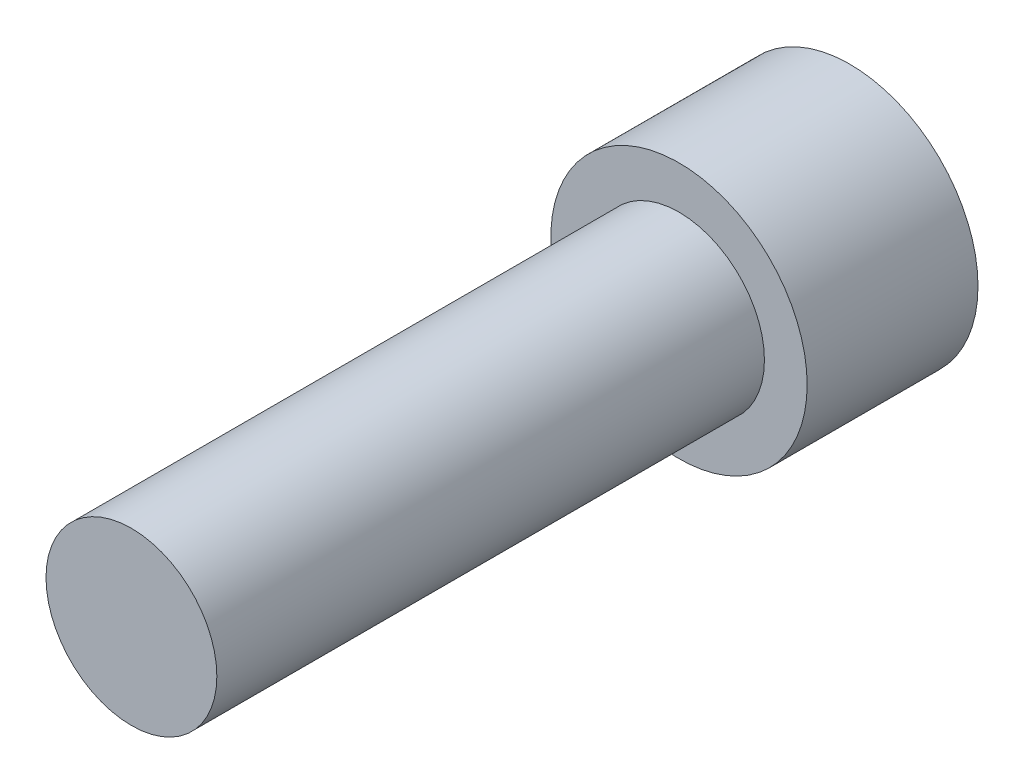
ISO-10303-21;
HEADER;
FILE_DESCRIPTION(('STEP AP214'),'2;1');
FILE_NAME('part.step','',(''),(''),'','','');
FILE_SCHEMA(('AUTOMOTIVE_DESIGN { 1 0 10303 214 1 1 1 1 }'));
ENDSEC;
DATA;
#1=APPLICATION_CONTEXT('core data for automotive mechanical design processes');
#2=APPLICATION_PROTOCOL_DEFINITION('international standard','automotive_design',2000,#1);
#3=PRODUCT_CONTEXT('',#1,'mechanical');
#4=PRODUCT('Part','Part','',(#3));
#5=PRODUCT_RELATED_PRODUCT_CATEGORY('part','',(#4));
#6=PRODUCT_DEFINITION_FORMATION('','',#4);
#7=PRODUCT_DEFINITION_CONTEXT('part definition',#1,'design');
#8=PRODUCT_DEFINITION('design','',#6,#7);
#9=PRODUCT_DEFINITION_SHAPE('','',#8);
#10=(LENGTH_UNIT() NAMED_UNIT(*) SI_UNIT(.MILLI.,.METRE.));
#11=(NAMED_UNIT(*) PLANE_ANGLE_UNIT() SI_UNIT($,.RADIAN.));
#12=(NAMED_UNIT(*) SI_UNIT($,.STERADIAN.) SOLID_ANGLE_UNIT());
#13=UNCERTAINTY_MEASURE_WITH_UNIT(LENGTH_MEASURE(1.E-05),#10,'distance_accuracy_value','');
#14=(GEOMETRIC_REPRESENTATION_CONTEXT(3) GLOBAL_UNCERTAINTY_ASSIGNED_CONTEXT((#13)) GLOBAL_UNIT_ASSIGNED_CONTEXT((#10,
#11,#12)) REPRESENTATION_CONTEXT('',''));
#15=CARTESIAN_POINT('',(0.,0.,0.));
#16=DIRECTION('',(0.,0.,1.));
#17=DIRECTION('',(1.,0.,0.));
#18=AXIS2_PLACEMENT_3D('',#15,#16,#17);
#19=CARTESIAN_POINT('',(0.,0.,25.4));
#20=DIRECTION('',(0.,0.,1.));
#21=DIRECTION('',(1.,0.,0.));
#22=AXIS2_PLACEMENT_3D('',#19,#20,#21);
#23=PLANE('',#22);
#24=CARTESIAN_POINT('',(0.,0.,25.4));
#25=DIRECTION('',(0.,0.,1.));
#26=DIRECTION('',(1.,0.,0.));
#27=AXIS2_PLACEMENT_3D('',#24,#25,#26);
#28=CIRCLE('',#27,3.9624);
#29=CARTESIAN_POINT('',(3.9624,0.,25.4));
#30=VERTEX_POINT('',#29);
#31=EDGE_CURVE('E11',#30,#30,#28,.T.);
#32=ORIENTED_EDGE('',*,*,#31,.T.);
#33=EDGE_LOOP('',(#32));
#34=FACE_BOUND('',#33,.T.);
#35=ADVANCED_FACE('F32',(#34),#23,.T.);
#36=CARTESIAN_POINT('',(0.,0.,25.4));
#37=DIRECTION('',(0.,0.,1.));
#38=DIRECTION('',(1.,0.,0.));
#39=AXIS2_PLACEMENT_3D('',#36,#37,#38);
#40=CYLINDRICAL_SURFACE('',#39,3.9624);
#41=CARTESIAN_POINT('',(0.,0.,0.));
#42=DIRECTION('',(0.,0.,1.));
#43=DIRECTION('',(1.,0.,0.));
#44=AXIS2_PLACEMENT_3D('',#41,#42,#43);
#45=CIRCLE('',#44,3.9624);
#46=CARTESIAN_POINT('',(3.9624,0.,0.));
#47=VERTEX_POINT('',#46);
#48=EDGE_CURVE('E39',#47,#47,#45,.T.);
#49=ORIENTED_EDGE('',*,*,#48,.T.);
#50=EDGE_LOOP('',(#49));
#51=FACE_BOUND('',#50,.T.);
#52=ORIENTED_EDGE('',*,*,#31,.F.);
#53=EDGE_LOOP('',(#52));
#54=FACE_BOUND('',#53,.T.);
#55=ADVANCED_FACE('F146',(#51,#54),#40,.T.);
#56=CARTESIAN_POINT('',(0.,-3.9624,0.));
#57=DIRECTION('',(0.,0.,1.));
#58=DIRECTION('',(1.,0.,0.));
#59=AXIS2_PLACEMENT_3D('',#56,#57,#58);
#60=PLANE('',#59);
#61=CARTESIAN_POINT('',(0.,0.,0.));
#62=DIRECTION('',(0.,0.,1.));
#63=DIRECTION('',(1.,0.,0.));
#64=AXIS2_PLACEMENT_3D('',#61,#62,#63);
#65=CIRCLE('',#64,5.9436);
#66=CARTESIAN_POINT('',(5.9436,0.,0.));
#67=VERTEX_POINT('',#66);
#68=EDGE_CURVE('E141',#67,#67,#65,.T.);
#69=ORIENTED_EDGE('',*,*,#68,.T.);
#70=EDGE_LOOP('',(#69));
#71=FACE_BOUND('',#70,.T.);
#72=ORIENTED_EDGE('',*,*,#48,.F.);
#73=EDGE_LOOP('',(#72));
#74=FACE_BOUND('',#73,.T.);
#75=ADVANCED_FACE('F149',(#71,#74),#60,.T.);
#76=CARTESIAN_POINT('',(0.,0.,25.4));
#77=DIRECTION('',(0.,0.,1.));
#78=DIRECTION('',(1.,0.,0.));
#79=AXIS2_PLACEMENT_3D('',#76,#77,#78);
#80=CYLINDRICAL_SURFACE('',#79,5.9436);
#81=CARTESIAN_POINT('',(0.,0.,-7.9248));
#82=DIRECTION('',(0.,0.,1.));
#83=DIRECTION('',(1.,0.,0.));
#84=AXIS2_PLACEMENT_3D('',#81,#82,#83);
#85=CIRCLE('',#84,5.9436);
#86=CARTESIAN_POINT('',(5.9436,0.,-7.9248));
#87=VERTEX_POINT('',#86);
#88=EDGE_CURVE('E133',#87,#87,#85,.T.);
#89=ORIENTED_EDGE('',*,*,#88,.T.);
#90=EDGE_LOOP('',(#89));
#91=FACE_BOUND('',#90,.T.);
#92=ORIENTED_EDGE('',*,*,#68,.F.);
#93=EDGE_LOOP('',(#92));
#94=FACE_BOUND('',#93,.T.);
#95=ADVANCED_FACE('F151',(#91,#94),#80,.T.);
#96=CARTESIAN_POINT('',(0.,-5.9436,-7.9248));
#97=DIRECTION('',(0.,0.,-1.));
#98=DIRECTION('',(-1.,0.,0.));
#99=AXIS2_PLACEMENT_3D('',#96,#97,#98);
#100=PLANE('',#99);
#101=DIRECTION('',(0.866025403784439,-0.5,0.));
#102=VECTOR('',#101,1.);
#103=CARTESIAN_POINT('',(0.,3.66617420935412,-7.9248));
#104=LINE('',#103,#102);
#105=CARTESIAN_POINT('',(0.,3.66617420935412,-7.9248));
#106=VERTEX_POINT('',#105);
#107=CARTESIAN_POINT('',(3.175,1.83308710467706,-7.9248));
#108=VERTEX_POINT('',#107);
#109=EDGE_CURVE('E46',#106,#108,#104,.T.);
#110=ORIENTED_EDGE('',*,*,#109,.F.);
#111=DIRECTION('',(0.866025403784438,0.5,0.));
#112=VECTOR('',#111,1.);
#113=CARTESIAN_POINT('',(-3.175,1.83308710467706,-7.9248));
#114=LINE('',#113,#112);
#115=CARTESIAN_POINT('',(-3.175,1.83308710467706,-7.9248));
#116=VERTEX_POINT('',#115);
#117=EDGE_CURVE('E129',#116,#106,#114,.T.);
#118=ORIENTED_EDGE('',*,*,#117,.F.);
#119=DIRECTION('',(0.,1.,0.));
#120=VECTOR('',#119,1.);
#121=CARTESIAN_POINT('',(-3.175,-1.83308710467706,-7.9248));
#122=LINE('',#121,#120);
#123=CARTESIAN_POINT('',(-3.175,-1.83308710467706,-7.9248));
#124=VERTEX_POINT('',#123);
#125=EDGE_CURVE('E127',#124,#116,#122,.T.);
#126=ORIENTED_EDGE('',*,*,#125,.F.);
#127=DIRECTION('',(-0.866025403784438,0.5,0.));
#128=VECTOR('',#127,1.);
#129=CARTESIAN_POINT('',(0.,-3.66617420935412,-7.9248));
#130=LINE('',#129,#128);
#131=CARTESIAN_POINT('',(0.,-3.66617420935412,-7.9248));
#132=VERTEX_POINT('',#131);
#133=EDGE_CURVE('E94',#132,#124,#130,.T.);
#134=ORIENTED_EDGE('',*,*,#133,.F.);
#135=DIRECTION('',(-0.866025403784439,-0.5,0.));
#136=VECTOR('',#135,1.);
#137=CARTESIAN_POINT('',(3.175,-1.83308710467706,-7.9248));
#138=LINE('',#137,#136);
#139=CARTESIAN_POINT('',(3.175,-1.83308710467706,-7.9248));
#140=VERTEX_POINT('',#139);
#141=EDGE_CURVE('E123',#140,#132,#138,.T.);
#142=ORIENTED_EDGE('',*,*,#141,.F.);
#143=DIRECTION('',(0.,-1.,0.));
#144=VECTOR('',#143,1.);
#145=CARTESIAN_POINT('',(3.175,1.83308710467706,-7.9248));
#146=LINE('',#145,#144);
#147=EDGE_CURVE('E120',#108,#140,#146,.T.);
#148=ORIENTED_EDGE('',*,*,#147,.F.);
#149=EDGE_LOOP('',(#110,#118,#126,#134,#142,#148));
#150=FACE_BOUND('',#149,.T.);
#151=ORIENTED_EDGE('',*,*,#88,.F.);
#152=EDGE_LOOP('',(#151));
#153=FACE_BOUND('',#152,.T.);
#154=ADVANCED_FACE('F158',(#150,#153),#100,.T.);
#155=CARTESIAN_POINT('',(0.,3.66617420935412,-3.0988));
#156=DIRECTION('',(0.5,0.866025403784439,0.));
#157=DIRECTION('',(-0.866025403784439,0.5,0.));
#158=AXIS2_PLACEMENT_3D('',#155,#156,#157);
#159=PLANE('',#158);
#160=ORIENTED_EDGE('',*,*,#109,.T.);
#161=DIRECTION('',(0.,0.,-1.));
#162=VECTOR('',#161,1.);
#163=CARTESIAN_POINT('',(3.175,1.83308710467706,-3.0988));
#164=LINE('',#163,#162);
#165=CARTESIAN_POINT('',(3.175,1.83308710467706,-3.0988));
#166=VERTEX_POINT('',#165);
#167=EDGE_CURVE('E76',#166,#108,#164,.T.);
#168=ORIENTED_EDGE('',*,*,#167,.F.);
#169=DIRECTION('',(0.866025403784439,-0.5,0.));
#170=VECTOR('',#169,1.);
#171=CARTESIAN_POINT('',(0.,3.66617420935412,-3.0988));
#172=LINE('',#171,#170);
#173=CARTESIAN_POINT('',(0.,3.66617420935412,-3.0988));
#174=VERTEX_POINT('',#173);
#175=EDGE_CURVE('E131',#174,#166,#172,.T.);
#176=ORIENTED_EDGE('',*,*,#175,.F.);
#177=DIRECTION('',(0.,0.,-1.));
#178=VECTOR('',#177,1.);
#179=CARTESIAN_POINT('',(0.,3.66617420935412,-3.0988));
#180=LINE('',#179,#178);
#181=EDGE_CURVE('E54',#174,#106,#180,.T.);
#182=ORIENTED_EDGE('',*,*,#181,.T.);
#183=EDGE_LOOP('',(#160,#168,#176,#182));
#184=FACE_BOUND('',#183,.T.);
#185=ADVANCED_FACE('F189',(#184),#159,.F.);
#186=CARTESIAN_POINT('',(-3.175,1.83308710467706,-3.0988));
#187=DIRECTION('',(-0.5,0.866025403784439,0.));
#188=DIRECTION('',(-0.866025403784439,-0.5,0.));
#189=AXIS2_PLACEMENT_3D('',#186,#187,#188);
#190=PLANE('',#189);
#191=ORIENTED_EDGE('',*,*,#117,.T.);
#192=ORIENTED_EDGE('',*,*,#181,.F.);
#193=DIRECTION('',(0.866025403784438,0.5,0.));
#194=VECTOR('',#193,1.);
#195=CARTESIAN_POINT('',(-3.175,1.83308710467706,-3.0988));
#196=LINE('',#195,#194);
#197=CARTESIAN_POINT('',(-3.175,1.83308710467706,-3.0988));
#198=VERTEX_POINT('',#197);
#199=EDGE_CURVE('E106',#198,#174,#196,.T.);
#200=ORIENTED_EDGE('',*,*,#199,.F.);
#201=DIRECTION('',(0.,0.,-1.));
#202=VECTOR('',#201,1.);
#203=CARTESIAN_POINT('',(-3.175,1.83308710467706,-3.0988));
#204=LINE('',#203,#202);
#205=EDGE_CURVE('E98',#198,#116,#204,.T.);
#206=ORIENTED_EDGE('',*,*,#205,.T.);
#207=EDGE_LOOP('',(#191,#192,#200,#206));
#208=FACE_BOUND('',#207,.T.);
#209=ADVANCED_FACE('F199',(#208),#190,.F.);
#210=CARTESIAN_POINT('',(-3.175,-1.83308710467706,-3.0988));
#211=DIRECTION('',(-1.,0.,0.));
#212=DIRECTION('',(0.,-1.,0.));
#213=AXIS2_PLACEMENT_3D('',#210,#211,#212);
#214=PLANE('',#213);
#215=ORIENTED_EDGE('',*,*,#125,.T.);
#216=ORIENTED_EDGE('',*,*,#205,.F.);
#217=DIRECTION('',(0.,1.,0.));
#218=VECTOR('',#217,1.);
#219=CARTESIAN_POINT('',(-3.175,-1.83308710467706,-3.0988));
#220=LINE('',#219,#218);
#221=CARTESIAN_POINT('',(-3.175,-1.83308710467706,-3.0988));
#222=VERTEX_POINT('',#221);
#223=EDGE_CURVE('E102',#222,#198,#220,.T.);
#224=ORIENTED_EDGE('',*,*,#223,.F.);
#225=DIRECTION('',(0.,0.,-1.));
#226=VECTOR('',#225,1.);
#227=CARTESIAN_POINT('',(-3.175,-1.83308710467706,-3.0988));
#228=LINE('',#227,#226);
#229=EDGE_CURVE('E87',#222,#124,#228,.T.);
#230=ORIENTED_EDGE('',*,*,#229,.T.);
#231=EDGE_LOOP('',(#215,#216,#224,#230));
#232=FACE_BOUND('',#231,.T.);
#233=ADVANCED_FACE('F103',(#232),#214,.F.);
#234=CARTESIAN_POINT('',(0.,-3.66617420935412,-3.0988));
#235=DIRECTION('',(-0.5,-0.866025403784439,0.));
#236=DIRECTION('',(0.866025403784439,-0.5,0.));
#237=AXIS2_PLACEMENT_3D('',#234,#235,#236);
#238=PLANE('',#237);
#239=ORIENTED_EDGE('',*,*,#133,.T.);
#240=ORIENTED_EDGE('',*,*,#229,.F.);
#241=DIRECTION('',(-0.866025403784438,0.5,0.));
#242=VECTOR('',#241,1.);
#243=CARTESIAN_POINT('',(0.,-3.66617420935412,-3.0988));
#244=LINE('',#243,#242);
#245=CARTESIAN_POINT('',(0.,-3.66617420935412,-3.0988));
#246=VERTEX_POINT('',#245);
#247=EDGE_CURVE('E91',#246,#222,#244,.T.);
#248=ORIENTED_EDGE('',*,*,#247,.F.);
#249=DIRECTION('',(0.,0.,-1.));
#250=VECTOR('',#249,1.);
#251=CARTESIAN_POINT('',(0.,-3.66617420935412,-3.0988));
#252=LINE('',#251,#250);
#253=EDGE_CURVE('E99',#246,#132,#252,.T.);
#254=ORIENTED_EDGE('',*,*,#253,.T.);
#255=EDGE_LOOP('',(#239,#240,#248,#254));
#256=FACE_BOUND('',#255,.T.);
#257=ADVANCED_FACE('F89',(#256),#238,.F.);
#258=CARTESIAN_POINT('',(3.175,-1.83308710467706,-3.0988));
#259=DIRECTION('',(0.5,-0.866025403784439,0.));
#260=DIRECTION('',(0.866025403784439,0.5,0.));
#261=AXIS2_PLACEMENT_3D('',#258,#259,#260);
#262=PLANE('',#261);
#263=ORIENTED_EDGE('',*,*,#141,.T.);
#264=ORIENTED_EDGE('',*,*,#253,.F.);
#265=DIRECTION('',(-0.866025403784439,-0.5,0.));
#266=VECTOR('',#265,1.);
#267=CARTESIAN_POINT('',(3.175,-1.83308710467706,-3.0988));
#268=LINE('',#267,#266);
#269=CARTESIAN_POINT('',(3.175,-1.83308710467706,-3.0988));
#270=VERTEX_POINT('',#269);
#271=EDGE_CURVE('E112',#270,#246,#268,.T.);
#272=ORIENTED_EDGE('',*,*,#271,.F.);
#273=DIRECTION('',(0.,0.,-1.));
#274=VECTOR('',#273,1.);
#275=CARTESIAN_POINT('',(3.175,-1.83308710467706,-3.0988));
#276=LINE('',#275,#274);
#277=EDGE_CURVE('E136',#270,#140,#276,.T.);
#278=ORIENTED_EDGE('',*,*,#277,.T.);
#279=EDGE_LOOP('',(#263,#264,#272,#278));
#280=FACE_BOUND('',#279,.T.);
#281=ADVANCED_FACE('F224',(#280),#262,.F.);
#282=CARTESIAN_POINT('',(3.175,1.83308710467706,-3.0988));
#283=DIRECTION('',(1.,0.,0.));
#284=DIRECTION('',(0.,0.,-1.));
#285=AXIS2_PLACEMENT_3D('',#282,#283,#284);
#286=PLANE('',#285);
#287=ORIENTED_EDGE('',*,*,#147,.T.);
#288=ORIENTED_EDGE('',*,*,#277,.F.);
#289=DIRECTION('',(0.,-1.,0.));
#290=VECTOR('',#289,1.);
#291=CARTESIAN_POINT('',(3.175,1.83308710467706,-3.0988));
#292=LINE('',#291,#290);
#293=EDGE_CURVE('E114',#166,#270,#292,.T.);
#294=ORIENTED_EDGE('',*,*,#293,.F.);
#295=ORIENTED_EDGE('',*,*,#167,.T.);
#296=EDGE_LOOP('',(#287,#288,#294,#295));
#297=FACE_BOUND('',#296,.T.);
#298=ADVANCED_FACE('F233',(#297),#286,.F.);
#299=CARTESIAN_POINT('',(0.,3.66617420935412,-3.0988));
#300=DIRECTION('',(0.,0.,1.));
#301=DIRECTION('',(1.,0.,0.));
#302=AXIS2_PLACEMENT_3D('',#299,#300,#301);
#303=PLANE('',#302);
#304=ORIENTED_EDGE('',*,*,#175,.T.);
#305=ORIENTED_EDGE('',*,*,#293,.T.);
#306=ORIENTED_EDGE('',*,*,#271,.T.);
#307=ORIENTED_EDGE('',*,*,#247,.T.);
#308=ORIENTED_EDGE('',*,*,#223,.T.);
#309=ORIENTED_EDGE('',*,*,#199,.T.);
#310=EDGE_LOOP('',(#304,#305,#306,#307,#308,#309));
#311=FACE_BOUND('',#310,.T.);
#312=ADVANCED_FACE('F109',(#311),#303,.F.);
#313=CLOSED_SHELL('',(#35,#55,#75,#95,#154,#185,#209,#233,#257,#281,#298,#312));
#314=MANIFOLD_SOLID_BREP('B2',#313);
#315=ADVANCED_BREP_SHAPE_REPRESENTATION('',(#18,#314),#14);
#316=SHAPE_DEFINITION_REPRESENTATION(#9,#315);
ENDSEC;
END-ISO-10303-21;
